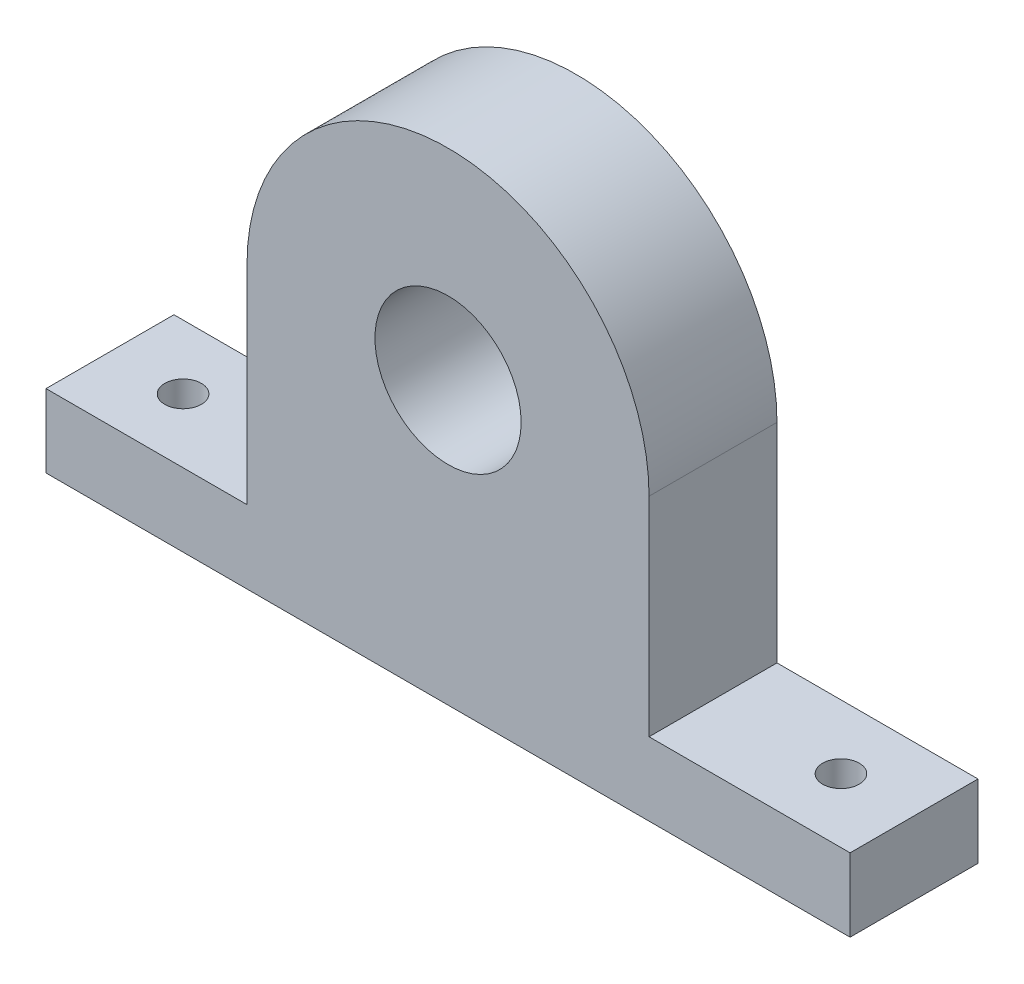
from build123d import *

# Parameters (mm, degrees)
EXTRUDE_1_DEPTH     = 17.5
SKETCH_2_R          = 5
CUT_EXTRUDE_1_DEPTH = 35
SKETCH_3_R          = 20
CUT_EXTRUDE_2_DEPTH = 35


with BuildPart() as part:
    # Sketch 1 → Extrude 1 (new, symmetric)
    with BuildSketch(Plane.XY):
        with BuildLine():
            Line((-55, -57), (-110, -57))
            Line((-110, -57), (-110, -77))
            Line((-110, -77), (110, -77))
            Line((110, -77), (110, -57))
            Line((110, -57), (55, -57))
            Line((55, -57), (55, 0))
            ThreePointArc((55, 0), (0, 55), (-55, 0))
            Line((-55, 0), (-55, -57))
        make_face()
    extrude(amount=EXTRUDE_1_DEPTH, both=True)

    # Sketch 2 → Cut-Extrude 1 (cut)
    with BuildSketch(Plane.XZ.offset(77)):
        with Locations(Location((90, 0, 0), (0, 0, 270))):
            Circle(SKETCH_2_R)
        with Locations(Location((-90, 0, 0), (0, 0, 270))):
            Circle(SKETCH_2_R)
    extrude(amount=-CUT_EXTRUDE_1_DEPTH, mode=Mode.SUBTRACT)

    # Sketch 3 → Cut-Extrude 2 (cut)
    with BuildSketch(Plane.XY.offset(17.5)):
        Circle(SKETCH_3_R)
    extrude(amount=-CUT_EXTRUDE_2_DEPTH, mode=Mode.SUBTRACT)


solid = part.part
